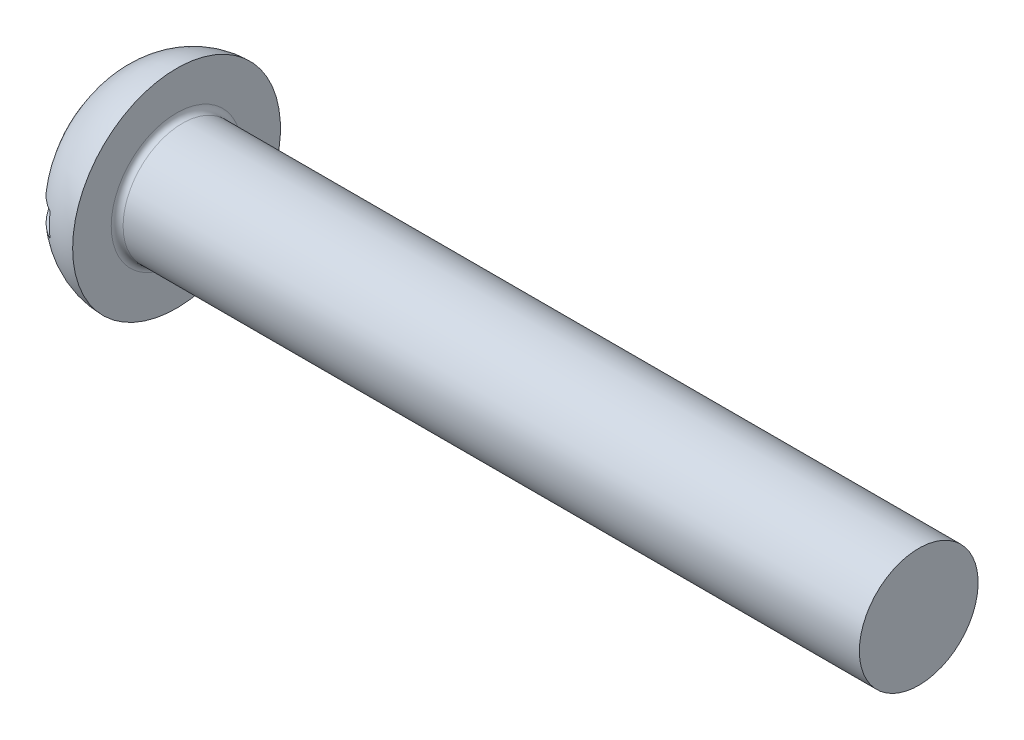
from build123d import *

# Parameters (mm, degrees)
FILLET1_R  = 0.4
SLOTSKE_W  = 14
SLOTSKE_H  = 1.6
SLOT_DEPTH = 3.3


with BuildPart() as part:
    # BodySke → BaseBody (revolve)
    with BuildSketch(Plane.XY, mode=Mode.PRIVATE) as basebody_sk:
        with BuildLine():
            Line((5.4, 4), (5.4, 7))
            ThreePointArc((5.4, 7), (3.455602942, 6.543518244), (1.887955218, 5.30596577))
            ThreePointArc((1.887955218, 5.30596577), (0.486051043, 2.815921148), (0, 0))
            Line((0, 0), (55.4, 0))
            Line((55.4, 0), (55.4, 4))
            Line((55.4, 4), (5.4, 4))
        make_face()
    revolve(basebody_sk.sketch.rotate(Axis((0, 0, 0), (1, 0, 0)), 90), axis=Axis((0, 0, 0), (1, 0, 0)))

    # Fillet1
    fillet1_edges = [part.edges().sort_by_distance(p)[0] for p in [
        (5.4, 0, -4),
    ]]
    fillet(fillet1_edges, radius=FILLET1_R)

    # SlotSke → Slot (cut)
    with BuildSketch(Plane(origin=(0, 0, 0), x_dir=(0, 0, -1), z_dir=(1, 0, 0))):
        Rectangle(SLOTSKE_W, SLOTSKE_H)
    extrude(amount=SLOT_DEPTH, mode=Mode.SUBTRACT)


solid = part.part
